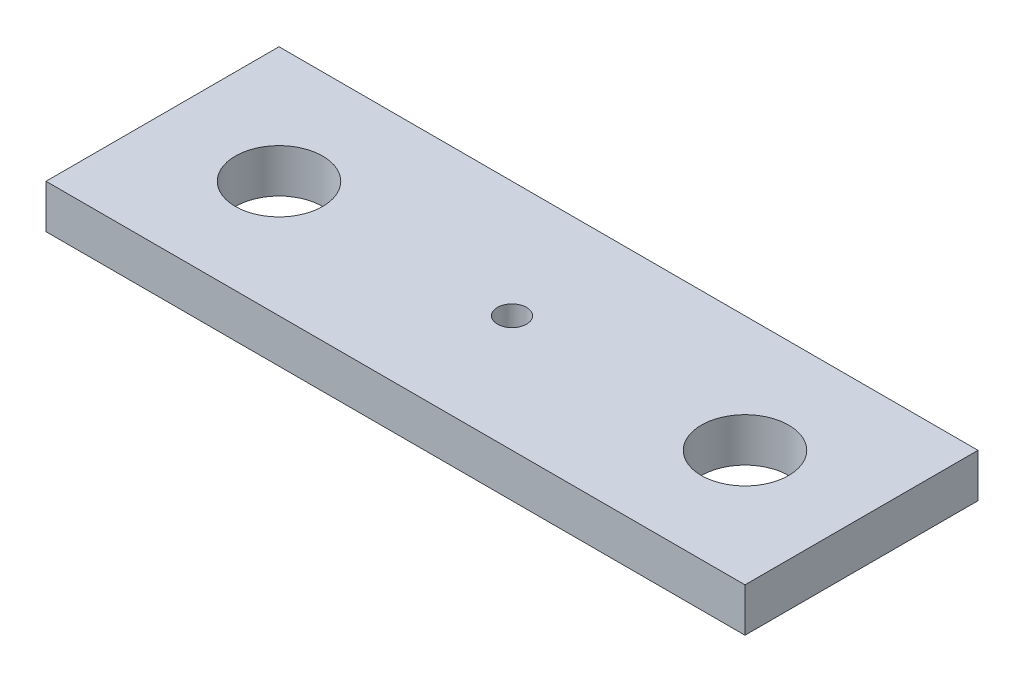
ISO-10303-21;
HEADER;
FILE_DESCRIPTION(('STEP AP214'),'2;1');
FILE_NAME('part.step','',(''),(''),'','','');
FILE_SCHEMA(('AUTOMOTIVE_DESIGN { 1 0 10303 214 1 1 1 1 }'));
ENDSEC;
DATA;
#1=APPLICATION_CONTEXT('core data for automotive mechanical design processes');
#2=APPLICATION_PROTOCOL_DEFINITION('international standard','automotive_design',2000,#1);
#3=PRODUCT_CONTEXT('',#1,'mechanical');
#4=PRODUCT('Part','Part','',(#3));
#5=PRODUCT_RELATED_PRODUCT_CATEGORY('part','',(#4));
#6=PRODUCT_DEFINITION_FORMATION('','',#4);
#7=PRODUCT_DEFINITION_CONTEXT('part definition',#1,'design');
#8=PRODUCT_DEFINITION('design','',#6,#7);
#9=PRODUCT_DEFINITION_SHAPE('','',#8);
#10=(LENGTH_UNIT() NAMED_UNIT(*) SI_UNIT(.MILLI.,.METRE.));
#11=(NAMED_UNIT(*) PLANE_ANGLE_UNIT() SI_UNIT($,.RADIAN.));
#12=(NAMED_UNIT(*) SI_UNIT($,.STERADIAN.) SOLID_ANGLE_UNIT());
#13=UNCERTAINTY_MEASURE_WITH_UNIT(LENGTH_MEASURE(1.E-05),#10,'distance_accuracy_value','');
#14=(GEOMETRIC_REPRESENTATION_CONTEXT(3) GLOBAL_UNCERTAINTY_ASSIGNED_CONTEXT((#13)) GLOBAL_UNIT_ASSIGNED_CONTEXT((#10,
#11,#12)) REPRESENTATION_CONTEXT('',''));
#15=CARTESIAN_POINT('',(0.,0.,0.));
#16=DIRECTION('',(0.,0.,1.));
#17=DIRECTION('',(1.,0.,0.));
#18=AXIS2_PLACEMENT_3D('',#15,#16,#17);
#19=CARTESIAN_POINT('',(-76.2,9.525,-25.4));
#20=DIRECTION('',(1.,0.,0.));
#21=DIRECTION('',(0.,0.,-1.));
#22=AXIS2_PLACEMENT_3D('',#19,#20,#21);
#23=PLANE('',#22);
#24=DIRECTION('',(0.,0.,1.));
#25=VECTOR('',#24,1.);
#26=CARTESIAN_POINT('',(-76.2,0.,-25.4));
#27=LINE('',#26,#25);
#28=CARTESIAN_POINT('',(-76.2,0.,-25.4));
#29=VERTEX_POINT('',#28);
#30=CARTESIAN_POINT('',(-76.2,0.,25.4));
#31=VERTEX_POINT('',#30);
#32=EDGE_CURVE('E78',#29,#31,#27,.T.);
#33=ORIENTED_EDGE('',*,*,#32,.T.);
#34=DIRECTION('',(0.,-1.,0.));
#35=VECTOR('',#34,1.);
#36=CARTESIAN_POINT('',(-76.2,9.525,25.4));
#37=LINE('',#36,#35);
#38=CARTESIAN_POINT('',(-76.2,9.525,25.4));
#39=VERTEX_POINT('',#38);
#40=EDGE_CURVE('E11',#39,#31,#37,.T.);
#41=ORIENTED_EDGE('',*,*,#40,.F.);
#42=DIRECTION('',(0.,0.,1.));
#43=VECTOR('',#42,1.);
#44=CARTESIAN_POINT('',(-76.2,9.525,-25.4));
#45=LINE('',#44,#43);
#46=CARTESIAN_POINT('',(-76.2,9.525,-25.4));
#47=VERTEX_POINT('',#46);
#48=EDGE_CURVE('E101',#47,#39,#45,.T.);
#49=ORIENTED_EDGE('',*,*,#48,.F.);
#50=DIRECTION('',(0.,-1.,0.));
#51=VECTOR('',#50,1.);
#52=CARTESIAN_POINT('',(-76.2,9.525,-25.4));
#53=LINE('',#52,#51);
#54=EDGE_CURVE('E90',#47,#29,#53,.T.);
#55=ORIENTED_EDGE('',*,*,#54,.T.);
#56=EDGE_LOOP('',(#33,#41,#49,#55));
#57=FACE_BOUND('',#56,.T.);
#58=ADVANCED_FACE('F34',(#57),#23,.F.);
#59=CARTESIAN_POINT('',(-76.2,9.525,25.4));
#60=DIRECTION('',(0.,0.,-1.));
#61=DIRECTION('',(-1.,0.,0.));
#62=AXIS2_PLACEMENT_3D('',#59,#60,#61);
#63=PLANE('',#62);
#64=DIRECTION('',(1.,0.,0.));
#65=VECTOR('',#64,1.);
#66=CARTESIAN_POINT('',(-76.2,0.,25.4));
#67=LINE('',#66,#65);
#68=CARTESIAN_POINT('',(76.2,0.,25.4));
#69=VERTEX_POINT('',#68);
#70=EDGE_CURVE('E74',#31,#69,#67,.T.);
#71=ORIENTED_EDGE('',*,*,#70,.T.);
#72=DIRECTION('',(0.,-1.,0.));
#73=VECTOR('',#72,1.);
#74=CARTESIAN_POINT('',(76.2,9.525,25.4));
#75=LINE('',#74,#73);
#76=CARTESIAN_POINT('',(76.2,9.525,25.4));
#77=VERTEX_POINT('',#76);
#78=EDGE_CURVE('E41',#77,#69,#75,.T.);
#79=ORIENTED_EDGE('',*,*,#78,.F.);
#80=DIRECTION('',(1.,0.,0.));
#81=VECTOR('',#80,1.);
#82=CARTESIAN_POINT('',(-76.2,9.525,25.4));
#83=LINE('',#82,#81);
#84=EDGE_CURVE('E86',#39,#77,#83,.T.);
#85=ORIENTED_EDGE('',*,*,#84,.F.);
#86=ORIENTED_EDGE('',*,*,#40,.T.);
#87=EDGE_LOOP('',(#71,#79,#85,#86));
#88=FACE_BOUND('',#87,.T.);
#89=ADVANCED_FACE('F85',(#88),#63,.F.);
#90=CARTESIAN_POINT('',(76.2,9.525,-25.4));
#91=DIRECTION('',(-1.,0.,0.));
#92=DIRECTION('',(0.,0.,1.));
#93=AXIS2_PLACEMENT_3D('',#90,#91,#92);
#94=PLANE('',#93);
#95=DIRECTION('',(0.,0.,-1.));
#96=VECTOR('',#95,1.);
#97=CARTESIAN_POINT('',(76.2,0.,-25.4));
#98=LINE('',#97,#96);
#99=CARTESIAN_POINT('',(76.2,0.,-25.4));
#100=VERTEX_POINT('',#99);
#101=EDGE_CURVE('E79',#69,#100,#98,.T.);
#102=ORIENTED_EDGE('',*,*,#101,.T.);
#103=DIRECTION('',(0.,-1.,0.));
#104=VECTOR('',#103,1.);
#105=CARTESIAN_POINT('',(76.2,9.525,-25.4));
#106=LINE('',#105,#104);
#107=CARTESIAN_POINT('',(76.2,9.525,-25.4));
#108=VERTEX_POINT('',#107);
#109=EDGE_CURVE('E107',#108,#100,#106,.T.);
#110=ORIENTED_EDGE('',*,*,#109,.F.);
#111=DIRECTION('',(0.,0.,-1.));
#112=VECTOR('',#111,1.);
#113=CARTESIAN_POINT('',(76.2,9.525,-25.4));
#114=LINE('',#113,#112);
#115=EDGE_CURVE('E53',#77,#108,#114,.T.);
#116=ORIENTED_EDGE('',*,*,#115,.F.);
#117=ORIENTED_EDGE('',*,*,#78,.T.);
#118=EDGE_LOOP('',(#102,#110,#116,#117));
#119=FACE_BOUND('',#118,.T.);
#120=ADVANCED_FACE('F110',(#119),#94,.F.);
#121=CARTESIAN_POINT('',(-76.2,9.525,-25.4));
#122=DIRECTION('',(0.,0.,1.));
#123=DIRECTION('',(1.,0.,0.));
#124=AXIS2_PLACEMENT_3D('',#121,#122,#123);
#125=PLANE('',#124);
#126=DIRECTION('',(-1.,0.,0.));
#127=VECTOR('',#126,1.);
#128=CARTESIAN_POINT('',(-76.2,0.,-25.4));
#129=LINE('',#128,#127);
#130=EDGE_CURVE('E99',#100,#29,#129,.T.);
#131=ORIENTED_EDGE('',*,*,#130,.T.);
#132=ORIENTED_EDGE('',*,*,#54,.F.);
#133=DIRECTION('',(-1.,0.,0.));
#134=VECTOR('',#133,1.);
#135=CARTESIAN_POINT('',(-76.2,9.525,-25.4));
#136=LINE('',#135,#134);
#137=EDGE_CURVE('E48',#108,#47,#136,.T.);
#138=ORIENTED_EDGE('',*,*,#137,.F.);
#139=ORIENTED_EDGE('',*,*,#109,.T.);
#140=EDGE_LOOP('',(#131,#132,#138,#139));
#141=FACE_BOUND('',#140,.T.);
#142=ADVANCED_FACE('F112',(#141),#125,.F.);
#143=CARTESIAN_POINT('',(-76.2,9.525,-25.4));
#144=DIRECTION('',(0.,1.,0.));
#145=DIRECTION('',(0.,0.,1.));
#146=AXIS2_PLACEMENT_3D('',#143,#144,#145);
#147=PLANE('',#146);
#148=CARTESIAN_POINT('',(0.,9.525,0.));
#149=DIRECTION('',(0.,1.,0.));
#150=DIRECTION('',(0.,0.,1.));
#151=AXIS2_PLACEMENT_3D('',#148,#149,#150);
#152=CIRCLE('',#151,3.175);
#153=CARTESIAN_POINT('',(0.,9.525,3.175));
#154=VERTEX_POINT('',#153);
#155=EDGE_CURVE('E189',#154,#154,#152,.T.);
#156=ORIENTED_EDGE('',*,*,#155,.F.);
#157=EDGE_LOOP('',(#156));
#158=FACE_BOUND('',#157,.T.);
#159=CARTESIAN_POINT('',(50.8,9.525,0.));
#160=DIRECTION('',(0.,1.,0.));
#161=DIRECTION('',(0.,0.,1.));
#162=AXIS2_PLACEMENT_3D('',#159,#160,#161);
#163=CIRCLE('',#162,9.525);
#164=CARTESIAN_POINT('',(50.8,9.525,9.525));
#165=VERTEX_POINT('',#164);
#166=EDGE_CURVE('E191',#165,#165,#163,.T.);
#167=ORIENTED_EDGE('',*,*,#166,.F.);
#168=EDGE_LOOP('',(#167));
#169=FACE_BOUND('',#168,.T.);
#170=CARTESIAN_POINT('',(-50.8,9.525,0.));
#171=DIRECTION('',(0.,1.,0.));
#172=DIRECTION('',(0.,0.,1.));
#173=AXIS2_PLACEMENT_3D('',#170,#171,#172);
#174=CIRCLE('',#173,9.525);
#175=CARTESIAN_POINT('',(-50.8,9.525,9.525));
#176=VERTEX_POINT('',#175);
#177=EDGE_CURVE('E94',#176,#176,#174,.T.);
#178=ORIENTED_EDGE('',*,*,#177,.F.);
#179=EDGE_LOOP('',(#178));
#180=FACE_BOUND('',#179,.T.);
#181=ORIENTED_EDGE('',*,*,#48,.T.);
#182=ORIENTED_EDGE('',*,*,#84,.T.);
#183=ORIENTED_EDGE('',*,*,#115,.T.);
#184=ORIENTED_EDGE('',*,*,#137,.T.);
#185=EDGE_LOOP('',(#181,#182,#183,#184));
#186=FACE_BOUND('',#185,.T.);
#187=ADVANCED_FACE('F113',(#158,#169,#180,#186),#147,.T.);
#188=CARTESIAN_POINT('',(-76.2,0.,-25.4));
#189=DIRECTION('',(0.,1.,0.));
#190=DIRECTION('',(0.,0.,1.));
#191=AXIS2_PLACEMENT_3D('',#188,#189,#190);
#192=PLANE('',#191);
#193=CARTESIAN_POINT('',(0.,0.,0.));
#194=DIRECTION('',(0.,1.,0.));
#195=DIRECTION('',(0.,0.,1.));
#196=AXIS2_PLACEMENT_3D('',#193,#194,#195);
#197=CIRCLE('',#196,3.175);
#198=CARTESIAN_POINT('',(0.,0.,3.175));
#199=VERTEX_POINT('',#198);
#200=EDGE_CURVE('E187',#199,#199,#197,.T.);
#201=ORIENTED_EDGE('',*,*,#200,.T.);
#202=EDGE_LOOP('',(#201));
#203=FACE_BOUND('',#202,.T.);
#204=CARTESIAN_POINT('',(50.8,0.,0.));
#205=DIRECTION('',(0.,1.,0.));
#206=DIRECTION('',(0.,0.,1.));
#207=AXIS2_PLACEMENT_3D('',#204,#205,#206);
#208=CIRCLE('',#207,9.525);
#209=CARTESIAN_POINT('',(50.8,0.,9.525));
#210=VERTEX_POINT('',#209);
#211=EDGE_CURVE('E196',#210,#210,#208,.T.);
#212=ORIENTED_EDGE('',*,*,#211,.T.);
#213=EDGE_LOOP('',(#212));
#214=FACE_BOUND('',#213,.T.);
#215=CARTESIAN_POINT('',(-50.8,0.,0.));
#216=DIRECTION('',(0.,1.,0.));
#217=DIRECTION('',(0.,0.,1.));
#218=AXIS2_PLACEMENT_3D('',#215,#216,#217);
#219=CIRCLE('',#218,9.525);
#220=CARTESIAN_POINT('',(-50.8,0.,9.525));
#221=VERTEX_POINT('',#220);
#222=EDGE_CURVE('E91',#221,#221,#219,.T.);
#223=ORIENTED_EDGE('',*,*,#222,.T.);
#224=EDGE_LOOP('',(#223));
#225=FACE_BOUND('',#224,.T.);
#226=ORIENTED_EDGE('',*,*,#32,.F.);
#227=ORIENTED_EDGE('',*,*,#130,.F.);
#228=ORIENTED_EDGE('',*,*,#101,.F.);
#229=ORIENTED_EDGE('',*,*,#70,.F.);
#230=EDGE_LOOP('',(#226,#227,#228,#229));
#231=FACE_BOUND('',#230,.T.);
#232=ADVANCED_FACE('F75',(#203,#214,#225,#231),#192,.F.);
#233=CARTESIAN_POINT('',(-50.8,0.,0.));
#234=DIRECTION('',(0.,1.,0.));
#235=DIRECTION('',(0.,0.,1.));
#236=AXIS2_PLACEMENT_3D('',#233,#234,#235);
#237=CYLINDRICAL_SURFACE('',#236,9.525);
#238=CARTESIAN_POINT('',(-50.8,0.,9.525));
#239=CARTESIAN_POINT('',(-50.8,0.0992187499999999,9.525));
#240=CARTESIAN_POINT('',(-50.8,0.1984375,9.525));
#241=CARTESIAN_POINT('',(-50.8,0.396875,9.525));
#242=CARTESIAN_POINT('',(-50.8,0.49609375,9.525));
#243=CARTESIAN_POINT('',(-50.8,0.69453125,9.525));
#244=CARTESIAN_POINT('',(-50.8,0.79375,9.525));
#245=CARTESIAN_POINT('',(-50.8,0.9921875,9.525));
#246=CARTESIAN_POINT('',(-50.8,1.09140625,9.525));
#247=CARTESIAN_POINT('',(-50.8,1.28984375,9.525));
#248=CARTESIAN_POINT('',(-50.8,1.3890625,9.525));
#249=CARTESIAN_POINT('',(-50.8,1.5875,9.525));
#250=CARTESIAN_POINT('',(-50.8,1.68671875,9.525));
#251=CARTESIAN_POINT('',(-50.8,1.88515625,9.525));
#252=CARTESIAN_POINT('',(-50.8,1.984375,9.525));
#253=CARTESIAN_POINT('',(-50.8,2.1828125,9.525));
#254=CARTESIAN_POINT('',(-50.8,2.28203125,9.525));
#255=CARTESIAN_POINT('',(-50.8,2.48046875,9.525));
#256=CARTESIAN_POINT('',(-50.8,2.5796875,9.525));
#257=CARTESIAN_POINT('',(-50.8,2.778125,9.525));
#258=CARTESIAN_POINT('',(-50.8,2.87734375,9.525));
#259=CARTESIAN_POINT('',(-50.8,3.07578125,9.525));
#260=CARTESIAN_POINT('',(-50.8,3.175,9.525));
#261=CARTESIAN_POINT('',(-50.8,3.3734375,9.525));
#262=CARTESIAN_POINT('',(-50.8,3.47265625,9.525));
#263=CARTESIAN_POINT('',(-50.8,3.67109375,9.525));
#264=CARTESIAN_POINT('',(-50.8,3.7703125,9.525));
#265=CARTESIAN_POINT('',(-50.8,3.96875,9.525));
#266=CARTESIAN_POINT('',(-50.8,4.06796875,9.525));
#267=CARTESIAN_POINT('',(-50.8,4.26640625,9.525));
#268=CARTESIAN_POINT('',(-50.8,4.365625,9.525));
#269=CARTESIAN_POINT('',(-50.8,4.5640625,9.525));
#270=CARTESIAN_POINT('',(-50.8,4.66328125,9.525));
#271=CARTESIAN_POINT('',(-50.8,4.86171875,9.525));
#272=CARTESIAN_POINT('',(-50.8,4.9609375,9.525));
#273=CARTESIAN_POINT('',(-50.8,5.159375,9.525));
#274=CARTESIAN_POINT('',(-50.8,5.25859375,9.525));
#275=CARTESIAN_POINT('',(-50.8,5.45703125,9.525));
#276=CARTESIAN_POINT('',(-50.8,5.55625,9.525));
#277=CARTESIAN_POINT('',(-50.8,5.7546875,9.525));
#278=CARTESIAN_POINT('',(-50.8,5.85390625,9.525));
#279=CARTESIAN_POINT('',(-50.8,6.05234375,9.525));
#280=CARTESIAN_POINT('',(-50.8,6.1515625,9.525));
#281=CARTESIAN_POINT('',(-50.8,6.35,9.525));
#282=CARTESIAN_POINT('',(-50.8,6.44921875,9.525));
#283=CARTESIAN_POINT('',(-50.8,6.64765625,9.525));
#284=CARTESIAN_POINT('',(-50.8,6.746875,9.525));
#285=CARTESIAN_POINT('',(-50.8,6.9453125,9.525));
#286=CARTESIAN_POINT('',(-50.8,7.04453125,9.525));
#287=CARTESIAN_POINT('',(-50.8,7.24296875,9.525));
#288=CARTESIAN_POINT('',(-50.8,7.3421875,9.525));
#289=CARTESIAN_POINT('',(-50.8,7.540625,9.525));
#290=CARTESIAN_POINT('',(-50.8,7.63984375,9.525));
#291=CARTESIAN_POINT('',(-50.8,7.83828125,9.525));
#292=CARTESIAN_POINT('',(-50.8,7.9375,9.525));
#293=CARTESIAN_POINT('',(-50.8,8.1359375,9.525));
#294=CARTESIAN_POINT('',(-50.8,8.23515625,9.525));
#295=CARTESIAN_POINT('',(-50.8,8.43359375,9.525));
#296=CARTESIAN_POINT('',(-50.8,8.5328125,9.525));
#297=CARTESIAN_POINT('',(-50.8,8.73125,9.525));
#298=CARTESIAN_POINT('',(-50.8,8.83046875,9.525));
#299=CARTESIAN_POINT('',(-50.8,9.02890625,9.525));
#300=CARTESIAN_POINT('',(-50.8,9.128125,9.525));
#301=CARTESIAN_POINT('',(-50.8,9.3265625,9.525));
#302=CARTESIAN_POINT('',(-50.8,9.42578125,9.525));
#303=CARTESIAN_POINT('',(-50.8,9.525,9.525));
#304=B_SPLINE_CURVE_WITH_KNOTS('',3,(#238,#239,#240,#241,#242,#243,#244,#245,#246,#247,#248,
#249,#250,#251,#252,#253,#254,#255,#256,#257,#258,#259,#260,#261,#262,#263,#264,#265,#266,#267,
#268,#269,#270,#271,#272,#273,#274,#275,#276,#277,#278,#279,#280,#281,#282,#283,#284,#285,#286,
#287,#288,#289,#290,#291,#292,#293,#294,#295,#296,#297,#298,#299,#300,#301,#302,#303),
.UNSPECIFIED.,.F.,.F.,(4,2,2,2,2,2,2,2,2,2,2,2,2,2,2,2,2,2,2,2,2,2,2,2,2,2,2,2,2,2,2,2,4),(0.,
0.29765625,0.5953125,0.89296875,1.190625,1.48828125,1.7859375,2.08359375,2.38125,2.67890625,
2.9765625,3.27421875,3.571875,3.86953125,4.1671875,4.46484375,4.7625,5.06015625,5.3578125,
5.65546875,5.953125,6.25078125,6.5484375,6.84609375,7.14375,7.44140625,7.7390625,8.03671875,
8.334375,8.63203125,8.9296875,9.22734375,9.525),.UNSPECIFIED.);
#305=EDGE_CURVE('BSEAM121',#221,#176,#304,.T.);
#306=ORIENTED_EDGE('',*,*,#222,.F.);
#307=ORIENTED_EDGE('',*,*,#177,.T.);
#308=ORIENTED_EDGE('',*,*,#305,.T.);
#309=ORIENTED_EDGE('',*,*,#305,.F.);
#310=EDGE_LOOP('',(#306,#308,#307,#309));
#311=FACE_BOUND('',#310,.T.);
#312=ADVANCED_FACE('F121',(#311),#237,.F.);
#313=CARTESIAN_POINT('',(50.8,0.,0.));
#314=DIRECTION('',(0.,1.,0.));
#315=DIRECTION('',(0.,0.,1.));
#316=AXIS2_PLACEMENT_3D('',#313,#314,#315);
#317=CYLINDRICAL_SURFACE('',#316,9.525);
#318=CARTESIAN_POINT('',(50.8,0.,9.525));
#319=CARTESIAN_POINT('',(50.8,0.0992187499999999,9.525));
#320=CARTESIAN_POINT('',(50.8,0.1984375,9.525));
#321=CARTESIAN_POINT('',(50.8,0.396875,9.525));
#322=CARTESIAN_POINT('',(50.8,0.49609375,9.525));
#323=CARTESIAN_POINT('',(50.8,0.69453125,9.525));
#324=CARTESIAN_POINT('',(50.8,0.79375,9.525));
#325=CARTESIAN_POINT('',(50.8,0.9921875,9.525));
#326=CARTESIAN_POINT('',(50.8,1.09140625,9.525));
#327=CARTESIAN_POINT('',(50.8,1.28984375,9.525));
#328=CARTESIAN_POINT('',(50.8,1.3890625,9.525));
#329=CARTESIAN_POINT('',(50.8,1.5875,9.525));
#330=CARTESIAN_POINT('',(50.8,1.68671875,9.525));
#331=CARTESIAN_POINT('',(50.8,1.88515625,9.525));
#332=CARTESIAN_POINT('',(50.8,1.984375,9.525));
#333=CARTESIAN_POINT('',(50.8,2.1828125,9.525));
#334=CARTESIAN_POINT('',(50.8,2.28203125,9.525));
#335=CARTESIAN_POINT('',(50.8,2.48046875,9.525));
#336=CARTESIAN_POINT('',(50.8,2.5796875,9.525));
#337=CARTESIAN_POINT('',(50.8,2.778125,9.525));
#338=CARTESIAN_POINT('',(50.8,2.87734375,9.525));
#339=CARTESIAN_POINT('',(50.8,3.07578125,9.525));
#340=CARTESIAN_POINT('',(50.8,3.175,9.525));
#341=CARTESIAN_POINT('',(50.8,3.3734375,9.525));
#342=CARTESIAN_POINT('',(50.8,3.47265625,9.525));
#343=CARTESIAN_POINT('',(50.8,3.67109375,9.525));
#344=CARTESIAN_POINT('',(50.8,3.7703125,9.525));
#345=CARTESIAN_POINT('',(50.8,3.96875,9.525));
#346=CARTESIAN_POINT('',(50.8,4.06796875,9.525));
#347=CARTESIAN_POINT('',(50.8,4.26640625,9.525));
#348=CARTESIAN_POINT('',(50.8,4.365625,9.525));
#349=CARTESIAN_POINT('',(50.8,4.5640625,9.525));
#350=CARTESIAN_POINT('',(50.8,4.66328125,9.525));
#351=CARTESIAN_POINT('',(50.8,4.86171875,9.525));
#352=CARTESIAN_POINT('',(50.8,4.9609375,9.525));
#353=CARTESIAN_POINT('',(50.8,5.159375,9.525));
#354=CARTESIAN_POINT('',(50.8,5.25859375,9.525));
#355=CARTESIAN_POINT('',(50.8,5.45703125,9.525));
#356=CARTESIAN_POINT('',(50.8,5.55625,9.525));
#357=CARTESIAN_POINT('',(50.8,5.7546875,9.525));
#358=CARTESIAN_POINT('',(50.8,5.85390625,9.525));
#359=CARTESIAN_POINT('',(50.8,6.05234375,9.525));
#360=CARTESIAN_POINT('',(50.8,6.1515625,9.525));
#361=CARTESIAN_POINT('',(50.8,6.35,9.525));
#362=CARTESIAN_POINT('',(50.8,6.44921875,9.525));
#363=CARTESIAN_POINT('',(50.8,6.64765625,9.525));
#364=CARTESIAN_POINT('',(50.8,6.746875,9.525));
#365=CARTESIAN_POINT('',(50.8,6.9453125,9.525));
#366=CARTESIAN_POINT('',(50.8,7.04453125,9.525));
#367=CARTESIAN_POINT('',(50.8,7.24296875,9.525));
#368=CARTESIAN_POINT('',(50.8,7.3421875,9.525));
#369=CARTESIAN_POINT('',(50.8,7.540625,9.525));
#370=CARTESIAN_POINT('',(50.8,7.63984375,9.525));
#371=CARTESIAN_POINT('',(50.8,7.83828125,9.525));
#372=CARTESIAN_POINT('',(50.8,7.9375,9.525));
#373=CARTESIAN_POINT('',(50.8,8.1359375,9.525));
#374=CARTESIAN_POINT('',(50.8,8.23515625,9.525));
#375=CARTESIAN_POINT('',(50.8,8.43359375,9.525));
#376=CARTESIAN_POINT('',(50.8,8.5328125,9.525));
#377=CARTESIAN_POINT('',(50.8,8.73125,9.525));
#378=CARTESIAN_POINT('',(50.8,8.83046875,9.525));
#379=CARTESIAN_POINT('',(50.8,9.02890625,9.525));
#380=CARTESIAN_POINT('',(50.8,9.128125,9.525));
#381=CARTESIAN_POINT('',(50.8,9.3265625,9.525));
#382=CARTESIAN_POINT('',(50.8,9.42578125,9.525));
#383=CARTESIAN_POINT('',(50.8,9.525,9.525));
#384=B_SPLINE_CURVE_WITH_KNOTS('',3,(#318,#319,#320,#321,#322,#323,#324,#325,#326,#327,#328,
#329,#330,#331,#332,#333,#334,#335,#336,#337,#338,#339,#340,#341,#342,#343,#344,#345,#346,#347,
#348,#349,#350,#351,#352,#353,#354,#355,#356,#357,#358,#359,#360,#361,#362,#363,#364,#365,#366,
#367,#368,#369,#370,#371,#372,#373,#374,#375,#376,#377,#378,#379,#380,#381,#382,#383),
.UNSPECIFIED.,.F.,.F.,(4,2,2,2,2,2,2,2,2,2,2,2,2,2,2,2,2,2,2,2,2,2,2,2,2,2,2,2,2,2,2,2,4),(0.,
0.29765625,0.5953125,0.89296875,1.190625,1.48828125,1.7859375,2.08359375,2.38125,2.67890625,
2.9765625,3.27421875,3.571875,3.86953125,4.1671875,4.46484375,4.7625,5.06015625,5.3578125,
5.65546875,5.953125,6.25078125,6.5484375,6.84609375,7.14375,7.44140625,7.7390625,8.03671875,
8.334375,8.63203125,8.9296875,9.22734375,9.525),.UNSPECIFIED.);
#385=EDGE_CURVE('BSEAM151',#210,#165,#384,.T.);
#386=ORIENTED_EDGE('',*,*,#211,.F.);
#387=ORIENTED_EDGE('',*,*,#166,.T.);
#388=ORIENTED_EDGE('',*,*,#385,.T.);
#389=ORIENTED_EDGE('',*,*,#385,.F.);
#390=EDGE_LOOP('',(#386,#388,#387,#389));
#391=FACE_BOUND('',#390,.T.);
#392=ADVANCED_FACE('F151',(#391),#317,.F.);
#393=CARTESIAN_POINT('',(0.,0.,0.));
#394=DIRECTION('',(0.,1.,0.));
#395=DIRECTION('',(0.,0.,1.));
#396=AXIS2_PLACEMENT_3D('',#393,#394,#395);
#397=CYLINDRICAL_SURFACE('',#396,3.175);
#398=CARTESIAN_POINT('',(0.,0.,3.175));
#399=CARTESIAN_POINT('',(0.,0.0992187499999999,3.175));
#400=CARTESIAN_POINT('',(0.,0.1984375,3.175));
#401=CARTESIAN_POINT('',(0.,0.396875,3.175));
#402=CARTESIAN_POINT('',(0.,0.49609375,3.175));
#403=CARTESIAN_POINT('',(0.,0.69453125,3.175));
#404=CARTESIAN_POINT('',(0.,0.79375,3.175));
#405=CARTESIAN_POINT('',(0.,0.9921875,3.175));
#406=CARTESIAN_POINT('',(0.,1.09140625,3.175));
#407=CARTESIAN_POINT('',(0.,1.28984375,3.175));
#408=CARTESIAN_POINT('',(0.,1.3890625,3.175));
#409=CARTESIAN_POINT('',(0.,1.5875,3.175));
#410=CARTESIAN_POINT('',(0.,1.68671875,3.175));
#411=CARTESIAN_POINT('',(0.,1.88515625,3.175));
#412=CARTESIAN_POINT('',(0.,1.984375,3.175));
#413=CARTESIAN_POINT('',(0.,2.1828125,3.175));
#414=CARTESIAN_POINT('',(0.,2.28203125,3.175));
#415=CARTESIAN_POINT('',(0.,2.48046875,3.175));
#416=CARTESIAN_POINT('',(0.,2.5796875,3.175));
#417=CARTESIAN_POINT('',(0.,2.778125,3.175));
#418=CARTESIAN_POINT('',(0.,2.87734375,3.175));
#419=CARTESIAN_POINT('',(0.,3.07578125,3.175));
#420=CARTESIAN_POINT('',(0.,3.175,3.175));
#421=CARTESIAN_POINT('',(0.,3.3734375,3.175));
#422=CARTESIAN_POINT('',(0.,3.47265625,3.175));
#423=CARTESIAN_POINT('',(0.,3.67109375,3.175));
#424=CARTESIAN_POINT('',(0.,3.7703125,3.175));
#425=CARTESIAN_POINT('',(0.,3.96875,3.175));
#426=CARTESIAN_POINT('',(0.,4.06796875,3.175));
#427=CARTESIAN_POINT('',(0.,4.26640625,3.175));
#428=CARTESIAN_POINT('',(0.,4.365625,3.175));
#429=CARTESIAN_POINT('',(0.,4.5640625,3.175));
#430=CARTESIAN_POINT('',(0.,4.66328125,3.175));
#431=CARTESIAN_POINT('',(0.,4.86171875,3.175));
#432=CARTESIAN_POINT('',(0.,4.9609375,3.175));
#433=CARTESIAN_POINT('',(0.,5.159375,3.175));
#434=CARTESIAN_POINT('',(0.,5.25859375,3.175));
#435=CARTESIAN_POINT('',(0.,5.45703125,3.175));
#436=CARTESIAN_POINT('',(0.,5.55625,3.175));
#437=CARTESIAN_POINT('',(0.,5.7546875,3.175));
#438=CARTESIAN_POINT('',(0.,5.85390625,3.175));
#439=CARTESIAN_POINT('',(0.,6.05234375,3.175));
#440=CARTESIAN_POINT('',(0.,6.1515625,3.175));
#441=CARTESIAN_POINT('',(0.,6.35,3.175));
#442=CARTESIAN_POINT('',(0.,6.44921875,3.175));
#443=CARTESIAN_POINT('',(0.,6.64765625,3.175));
#444=CARTESIAN_POINT('',(0.,6.746875,3.175));
#445=CARTESIAN_POINT('',(0.,6.9453125,3.175));
#446=CARTESIAN_POINT('',(0.,7.04453125,3.175));
#447=CARTESIAN_POINT('',(0.,7.24296875,3.175));
#448=CARTESIAN_POINT('',(0.,7.3421875,3.175));
#449=CARTESIAN_POINT('',(0.,7.540625,3.175));
#450=CARTESIAN_POINT('',(0.,7.63984375,3.175));
#451=CARTESIAN_POINT('',(0.,7.83828125,3.175));
#452=CARTESIAN_POINT('',(0.,7.9375,3.175));
#453=CARTESIAN_POINT('',(0.,8.1359375,3.175));
#454=CARTESIAN_POINT('',(0.,8.23515625,3.175));
#455=CARTESIAN_POINT('',(0.,8.43359375,3.175));
#456=CARTESIAN_POINT('',(0.,8.5328125,3.175));
#457=CARTESIAN_POINT('',(0.,8.73125,3.175));
#458=CARTESIAN_POINT('',(0.,8.83046875,3.175));
#459=CARTESIAN_POINT('',(0.,9.02890625,3.175));
#460=CARTESIAN_POINT('',(0.,9.128125,3.175));
#461=CARTESIAN_POINT('',(0.,9.3265625,3.175));
#462=CARTESIAN_POINT('',(0.,9.42578125,3.175));
#463=CARTESIAN_POINT('',(0.,9.525,3.175));
#464=B_SPLINE_CURVE_WITH_KNOTS('',3,(#398,#399,#400,#401,#402,#403,#404,#405,#406,#407,#408,
#409,#410,#411,#412,#413,#414,#415,#416,#417,#418,#419,#420,#421,#422,#423,#424,#425,#426,#427,
#428,#429,#430,#431,#432,#433,#434,#435,#436,#437,#438,#439,#440,#441,#442,#443,#444,#445,#446,
#447,#448,#449,#450,#451,#452,#453,#454,#455,#456,#457,#458,#459,#460,#461,#462,#463),
.UNSPECIFIED.,.F.,.F.,(4,2,2,2,2,2,2,2,2,2,2,2,2,2,2,2,2,2,2,2,2,2,2,2,2,2,2,2,2,2,2,2,4),(0.,
0.29765625,0.5953125,0.89296875,1.190625,1.48828125,1.7859375,2.08359375,2.38125,2.67890625,
2.9765625,3.27421875,3.571875,3.86953125,4.1671875,4.46484375,4.7625,5.06015625,5.3578125,
5.65546875,5.953125,6.25078125,6.5484375,6.84609375,7.14375,7.44140625,7.7390625,8.03671875,
8.334375,8.63203125,8.9296875,9.22734375,9.525),.UNSPECIFIED.);
#465=EDGE_CURVE('BSEAM161',#199,#154,#464,.T.);
#466=ORIENTED_EDGE('',*,*,#200,.F.);
#467=ORIENTED_EDGE('',*,*,#155,.T.);
#468=ORIENTED_EDGE('',*,*,#465,.T.);
#469=ORIENTED_EDGE('',*,*,#465,.F.);
#470=EDGE_LOOP('',(#466,#468,#467,#469));
#471=FACE_BOUND('',#470,.T.);
#472=ADVANCED_FACE('F161',(#471),#397,.F.);
#473=CLOSED_SHELL('',(#58,#89,#120,#142,#187,#232,#312,#392,#472));
#474=MANIFOLD_SOLID_BREP('B2',#473);
#475=ADVANCED_BREP_SHAPE_REPRESENTATION('',(#18,#474),#14);
#476=SHAPE_DEFINITION_REPRESENTATION(#9,#475);
ENDSEC;
END-ISO-10303-21;
